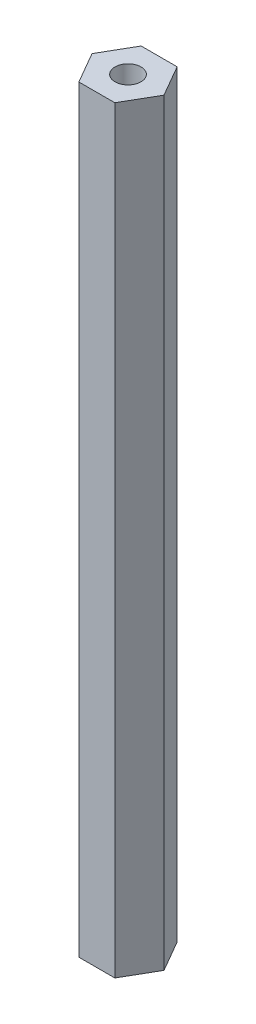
ISO-10303-21;
HEADER;
FILE_DESCRIPTION(('STEP AP214'),'2;1');
FILE_NAME('part.step','',(''),(''),'','','');
FILE_SCHEMA(('AUTOMOTIVE_DESIGN { 1 0 10303 214 1 1 1 1 }'));
ENDSEC;
DATA;
#1=APPLICATION_CONTEXT('core data for automotive mechanical design processes');
#2=APPLICATION_PROTOCOL_DEFINITION('international standard','automotive_design',2000,#1);
#3=PRODUCT_CONTEXT('',#1,'mechanical');
#4=PRODUCT('Part','Part','',(#3));
#5=PRODUCT_RELATED_PRODUCT_CATEGORY('part','',(#4));
#6=PRODUCT_DEFINITION_FORMATION('','',#4);
#7=PRODUCT_DEFINITION_CONTEXT('part definition',#1,'design');
#8=PRODUCT_DEFINITION('design','',#6,#7);
#9=PRODUCT_DEFINITION_SHAPE('','',#8);
#10=(LENGTH_UNIT() NAMED_UNIT(*) SI_UNIT(.MILLI.,.METRE.));
#11=(NAMED_UNIT(*) PLANE_ANGLE_UNIT() SI_UNIT($,.RADIAN.));
#12=(NAMED_UNIT(*) SI_UNIT($,.STERADIAN.) SOLID_ANGLE_UNIT());
#13=UNCERTAINTY_MEASURE_WITH_UNIT(LENGTH_MEASURE(1.E-05),#10,'distance_accuracy_value','');
#14=(GEOMETRIC_REPRESENTATION_CONTEXT(3) GLOBAL_UNCERTAINTY_ASSIGNED_CONTEXT((#13)) GLOBAL_UNIT_ASSIGNED_CONTEXT((#10,
#11,#12)) REPRESENTATION_CONTEXT('',''));
#15=CARTESIAN_POINT('',(0.,0.,0.));
#16=DIRECTION('',(0.,0.,1.));
#17=DIRECTION('',(1.,0.,0.));
#18=AXIS2_PLACEMENT_3D('',#15,#16,#17);
#19=CARTESIAN_POINT('',(1.73205080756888,73.,3.));
#20=DIRECTION('',(-0.866025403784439,0.,-0.5));
#21=DIRECTION('',(-0.5,0.,0.866025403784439));
#22=AXIS2_PLACEMENT_3D('',#19,#20,#21);
#23=PLANE('',#22);
#24=DIRECTION('',(0.5,0.,-0.866025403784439));
#25=VECTOR('',#24,1.);
#26=CARTESIAN_POINT('',(1.73205080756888,0.,3.));
#27=LINE('',#26,#25);
#28=CARTESIAN_POINT('',(1.73205080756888,0.,3.));
#29=VERTEX_POINT('',#28);
#30=CARTESIAN_POINT('',(3.46410161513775,0.,0.));
#31=VERTEX_POINT('',#30);
#32=EDGE_CURVE('E123',#29,#31,#27,.T.);
#33=ORIENTED_EDGE('',*,*,#32,.T.);
#34=DIRECTION('',(0.,-1.,0.));
#35=VECTOR('',#34,1.);
#36=CARTESIAN_POINT('',(3.46410161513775,73.,0.));
#37=LINE('',#36,#35);
#38=CARTESIAN_POINT('',(3.46410161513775,73.,0.));
#39=VERTEX_POINT('',#38);
#40=EDGE_CURVE('E11',#39,#31,#37,.T.);
#41=ORIENTED_EDGE('',*,*,#40,.F.);
#42=DIRECTION('',(0.5,0.,-0.866025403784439));
#43=VECTOR('',#42,1.);
#44=CARTESIAN_POINT('',(1.73205080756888,73.,3.));
#45=LINE('',#44,#43);
#46=CARTESIAN_POINT('',(1.73205080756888,73.,3.));
#47=VERTEX_POINT('',#46);
#48=EDGE_CURVE('E134',#47,#39,#45,.T.);
#49=ORIENTED_EDGE('',*,*,#48,.F.);
#50=DIRECTION('',(0.,-1.,0.));
#51=VECTOR('',#50,1.);
#52=CARTESIAN_POINT('',(1.73205080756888,73.,3.));
#53=LINE('',#52,#51);
#54=EDGE_CURVE('E119',#47,#29,#53,.T.);
#55=ORIENTED_EDGE('',*,*,#54,.T.);
#56=EDGE_LOOP('',(#33,#41,#49,#55));
#57=FACE_BOUND('',#56,.T.);
#58=ADVANCED_FACE('F36',(#57),#23,.F.);
#59=CARTESIAN_POINT('',(3.46410161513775,73.,0.));
#60=DIRECTION('',(-0.866025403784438,0.,0.5));
#61=DIRECTION('',(0.5,0.,0.866025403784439));
#62=AXIS2_PLACEMENT_3D('',#59,#60,#61);
#63=PLANE('',#62);
#64=DIRECTION('',(-0.5,0.,-0.866025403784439));
#65=VECTOR('',#64,1.);
#66=CARTESIAN_POINT('',(3.46410161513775,0.,0.));
#67=LINE('',#66,#65);
#68=CARTESIAN_POINT('',(1.73205080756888,0.,-3.));
#69=VERTEX_POINT('',#68);
#70=EDGE_CURVE('E126',#31,#69,#67,.T.);
#71=ORIENTED_EDGE('',*,*,#70,.T.);
#72=DIRECTION('',(0.,-1.,0.));
#73=VECTOR('',#72,1.);
#74=CARTESIAN_POINT('',(1.73205080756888,73.,-3.));
#75=LINE('',#74,#73);
#76=CARTESIAN_POINT('',(1.73205080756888,73.,-3.));
#77=VERTEX_POINT('',#76);
#78=EDGE_CURVE('E44',#77,#69,#75,.T.);
#79=ORIENTED_EDGE('',*,*,#78,.F.);
#80=DIRECTION('',(-0.5,0.,-0.866025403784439));
#81=VECTOR('',#80,1.);
#82=CARTESIAN_POINT('',(3.46410161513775,73.,0.));
#83=LINE('',#82,#81);
#84=EDGE_CURVE('E90',#39,#77,#83,.T.);
#85=ORIENTED_EDGE('',*,*,#84,.F.);
#86=ORIENTED_EDGE('',*,*,#40,.T.);
#87=EDGE_LOOP('',(#71,#79,#85,#86));
#88=FACE_BOUND('',#87,.T.);
#89=ADVANCED_FACE('F159',(#88),#63,.F.);
#90=CARTESIAN_POINT('',(1.73205080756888,73.,-3.));
#91=DIRECTION('',(0.,0.,1.));
#92=DIRECTION('',(1.,0.,0.));
#93=AXIS2_PLACEMENT_3D('',#90,#91,#92);
#94=PLANE('',#93);
#95=DIRECTION('',(-1.,0.,0.));
#96=VECTOR('',#95,1.);
#97=CARTESIAN_POINT('',(1.73205080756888,0.,-3.));
#98=LINE('',#97,#96);
#99=CARTESIAN_POINT('',(-1.73205080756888,0.,-3.));
#100=VERTEX_POINT('',#99);
#101=EDGE_CURVE('E129',#69,#100,#98,.T.);
#102=ORIENTED_EDGE('',*,*,#101,.T.);
#103=DIRECTION('',(0.,-1.,0.));
#104=VECTOR('',#103,1.);
#105=CARTESIAN_POINT('',(-1.73205080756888,73.,-3.));
#106=LINE('',#105,#104);
#107=CARTESIAN_POINT('',(-1.73205080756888,73.,-3.));
#108=VERTEX_POINT('',#107);
#109=EDGE_CURVE('E114',#108,#100,#106,.T.);
#110=ORIENTED_EDGE('',*,*,#109,.F.);
#111=DIRECTION('',(-1.,0.,0.));
#112=VECTOR('',#111,1.);
#113=CARTESIAN_POINT('',(1.73205080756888,73.,-3.));
#114=LINE('',#113,#112);
#115=EDGE_CURVE('E105',#77,#108,#114,.T.);
#116=ORIENTED_EDGE('',*,*,#115,.F.);
#117=ORIENTED_EDGE('',*,*,#78,.T.);
#118=EDGE_LOOP('',(#102,#110,#116,#117));
#119=FACE_BOUND('',#118,.T.);
#120=ADVANCED_FACE('F140',(#119),#94,.F.);
#121=CARTESIAN_POINT('',(-1.73205080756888,73.,-3.));
#122=DIRECTION('',(0.866025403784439,0.,0.5));
#123=DIRECTION('',(0.5,0.,-0.866025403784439));
#124=AXIS2_PLACEMENT_3D('',#121,#122,#123);
#125=PLANE('',#124);
#126=DIRECTION('',(-0.5,0.,0.866025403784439));
#127=VECTOR('',#126,1.);
#128=CARTESIAN_POINT('',(-1.73205080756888,0.,-3.));
#129=LINE('',#128,#127);
#130=CARTESIAN_POINT('',(-3.46410161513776,0.,0.));
#131=VERTEX_POINT('',#130);
#132=EDGE_CURVE('E113',#100,#131,#129,.T.);
#133=ORIENTED_EDGE('',*,*,#132,.T.);
#134=DIRECTION('',(0.,-1.,0.));
#135=VECTOR('',#134,1.);
#136=CARTESIAN_POINT('',(-3.46410161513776,73.,0.));
#137=LINE('',#136,#135);
#138=CARTESIAN_POINT('',(-3.46410161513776,73.,0.));
#139=VERTEX_POINT('',#138);
#140=EDGE_CURVE('E110',#139,#131,#137,.T.);
#141=ORIENTED_EDGE('',*,*,#140,.F.);
#142=DIRECTION('',(-0.5,0.,0.866025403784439));
#143=VECTOR('',#142,1.);
#144=CARTESIAN_POINT('',(-1.73205080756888,73.,-3.));
#145=LINE('',#144,#143);
#146=EDGE_CURVE('E99',#108,#139,#145,.T.);
#147=ORIENTED_EDGE('',*,*,#146,.F.);
#148=ORIENTED_EDGE('',*,*,#109,.T.);
#149=EDGE_LOOP('',(#133,#141,#147,#148));
#150=FACE_BOUND('',#149,.T.);
#151=ADVANCED_FACE('F111',(#150),#125,.F.);
#152=CARTESIAN_POINT('',(-3.46410161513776,73.,0.));
#153=DIRECTION('',(0.866025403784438,0.,-0.5));
#154=DIRECTION('',(-0.5,0.,-0.866025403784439));
#155=AXIS2_PLACEMENT_3D('',#152,#153,#154);
#156=PLANE('',#155);
#157=DIRECTION('',(0.5,0.,0.866025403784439));
#158=VECTOR('',#157,1.);
#159=CARTESIAN_POINT('',(-3.46410161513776,0.,0.));
#160=LINE('',#159,#158);
#161=CARTESIAN_POINT('',(-1.73205080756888,0.,3.));
#162=VERTEX_POINT('',#161);
#163=EDGE_CURVE('E76',#131,#162,#160,.T.);
#164=ORIENTED_EDGE('',*,*,#163,.T.);
#165=DIRECTION('',(0.,-1.,0.));
#166=VECTOR('',#165,1.);
#167=CARTESIAN_POINT('',(-1.73205080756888,73.,3.));
#168=LINE('',#167,#166);
#169=CARTESIAN_POINT('',(-1.73205080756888,73.,3.));
#170=VERTEX_POINT('',#169);
#171=EDGE_CURVE('E115',#170,#162,#168,.T.);
#172=ORIENTED_EDGE('',*,*,#171,.F.);
#173=DIRECTION('',(0.5,0.,0.866025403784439));
#174=VECTOR('',#173,1.);
#175=CARTESIAN_POINT('',(-3.46410161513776,73.,0.));
#176=LINE('',#175,#174);
#177=EDGE_CURVE('E103',#139,#170,#176,.T.);
#178=ORIENTED_EDGE('',*,*,#177,.F.);
#179=ORIENTED_EDGE('',*,*,#140,.T.);
#180=EDGE_LOOP('',(#164,#172,#178,#179));
#181=FACE_BOUND('',#180,.T.);
#182=ADVANCED_FACE('F117',(#181),#156,.F.);
#183=CARTESIAN_POINT('',(-1.73205080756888,73.,3.));
#184=DIRECTION('',(0.,0.,-1.));
#185=DIRECTION('',(-1.,0.,0.));
#186=AXIS2_PLACEMENT_3D('',#183,#184,#185);
#187=PLANE('',#186);
#188=DIRECTION('',(1.,0.,0.));
#189=VECTOR('',#188,1.);
#190=CARTESIAN_POINT('',(-1.73205080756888,0.,3.));
#191=LINE('',#190,#189);
#192=EDGE_CURVE('E82',#162,#29,#191,.T.);
#193=ORIENTED_EDGE('',*,*,#192,.T.);
#194=ORIENTED_EDGE('',*,*,#54,.F.);
#195=DIRECTION('',(1.,0.,0.));
#196=VECTOR('',#195,1.);
#197=CARTESIAN_POINT('',(-1.73205080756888,73.,3.));
#198=LINE('',#197,#196);
#199=EDGE_CURVE('E52',#170,#47,#198,.T.);
#200=ORIENTED_EDGE('',*,*,#199,.F.);
#201=ORIENTED_EDGE('',*,*,#171,.T.);
#202=EDGE_LOOP('',(#193,#194,#200,#201));
#203=FACE_BOUND('',#202,.T.);
#204=ADVANCED_FACE('F147',(#203),#187,.F.);
#205=CARTESIAN_POINT('',(0.,73.,0.));
#206=DIRECTION('',(0.,1.,0.));
#207=DIRECTION('',(0.,0.,1.));
#208=AXIS2_PLACEMENT_3D('',#205,#206,#207);
#209=PLANE('',#208);
#210=CARTESIAN_POINT('',(0.,73.,0.));
#211=DIRECTION('',(0.,1.,0.));
#212=DIRECTION('',(0.,0.,1.));
#213=AXIS2_PLACEMENT_3D('',#210,#211,#212);
#214=CIRCLE('',#213,1.24999999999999);
#215=CARTESIAN_POINT('',(0.,73.,1.24999999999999));
#216=VERTEX_POINT('',#215);
#217=EDGE_CURVE('E248',#216,#216,#214,.T.);
#218=ORIENTED_EDGE('',*,*,#217,.F.);
#219=EDGE_LOOP('',(#218));
#220=FACE_BOUND('',#219,.T.);
#221=ORIENTED_EDGE('',*,*,#48,.T.);
#222=ORIENTED_EDGE('',*,*,#84,.T.);
#223=ORIENTED_EDGE('',*,*,#115,.T.);
#224=ORIENTED_EDGE('',*,*,#146,.T.);
#225=ORIENTED_EDGE('',*,*,#177,.T.);
#226=ORIENTED_EDGE('',*,*,#199,.T.);
#227=EDGE_LOOP('',(#221,#222,#223,#224,#225,#226));
#228=FACE_BOUND('',#227,.T.);
#229=ADVANCED_FACE('F101',(#220,#228),#209,.T.);
#230=CARTESIAN_POINT('',(0.,0.,0.));
#231=DIRECTION('',(0.,1.,0.));
#232=DIRECTION('',(0.,0.,1.));
#233=AXIS2_PLACEMENT_3D('',#230,#231,#232);
#234=PLANE('',#233);
#235=CARTESIAN_POINT('',(0.,0.,0.));
#236=DIRECTION('',(0.,-1.,0.));
#237=DIRECTION('',(0.,0.,-1.));
#238=AXIS2_PLACEMENT_3D('',#235,#236,#237);
#239=CIRCLE('',#238,1.24999999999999);
#240=CARTESIAN_POINT('',(0.,0.,-1.24999999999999));
#241=VERTEX_POINT('',#240);
#242=EDGE_CURVE('E250',#241,#241,#239,.T.);
#243=ORIENTED_EDGE('',*,*,#242,.F.);
#244=EDGE_LOOP('',(#243));
#245=FACE_BOUND('',#244,.T.);
#246=ORIENTED_EDGE('',*,*,#32,.F.);
#247=ORIENTED_EDGE('',*,*,#192,.F.);
#248=ORIENTED_EDGE('',*,*,#163,.F.);
#249=ORIENTED_EDGE('',*,*,#132,.F.);
#250=ORIENTED_EDGE('',*,*,#101,.F.);
#251=ORIENTED_EDGE('',*,*,#70,.F.);
#252=EDGE_LOOP('',(#246,#247,#248,#249,#250,#251));
#253=FACE_BOUND('',#252,.T.);
#254=ADVANCED_FACE('F143',(#245,#253),#234,.F.);
#255=CARTESIAN_POINT('',(0.,12.,0.));
#256=DIRECTION('',(0.,-1.,0.));
#257=DIRECTION('',(0.,0.,-1.));
#258=AXIS2_PLACEMENT_3D('',#255,#256,#257);
#259=CONICAL_SURFACE('',#258,1.25,1.02974425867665);
#260=CARTESIAN_POINT('',(0.,12.7510757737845,0.));
#261=VERTEX_POINT('',#260);
#262=VERTEX_LOOP('',#261);
#263=FACE_BOUND('',#262,.T.);
#264=CARTESIAN_POINT('',(0.,12.,0.));
#265=DIRECTION('',(0.,-1.,0.));
#266=DIRECTION('',(0.,0.,-1.));
#267=AXIS2_PLACEMENT_3D('',#264,#265,#266);
#268=CIRCLE('',#267,1.25);
#269=CARTESIAN_POINT('',(0.,12.,-1.25));
#270=VERTEX_POINT('',#269);
#271=EDGE_CURVE('E127',#270,#270,#268,.T.);
#272=ORIENTED_EDGE('',*,*,#271,.T.);
#273=EDGE_LOOP('',(#272));
#274=FACE_BOUND('',#273,.T.);
#275=ADVANCED_FACE('F191',(#263,#274),#259,.F.);
#276=CARTESIAN_POINT('',(0.,0.,0.));
#277=DIRECTION('',(0.,-1.,0.));
#278=DIRECTION('',(0.,0.,-1.));
#279=AXIS2_PLACEMENT_3D('',#276,#277,#278);
#280=CYLINDRICAL_SURFACE('',#279,1.24999999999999);
#281=ORIENTED_EDGE('',*,*,#271,.F.);
#282=EDGE_LOOP('',(#281));
#283=FACE_BOUND('',#282,.T.);
#284=ORIENTED_EDGE('',*,*,#242,.T.);
#285=EDGE_LOOP('',(#284));
#286=FACE_BOUND('',#285,.T.);
#287=ADVANCED_FACE('F200',(#283,#286),#280,.F.);
#288=CARTESIAN_POINT('',(0.,61.,0.));
#289=DIRECTION('',(0.,1.,0.));
#290=DIRECTION('',(0.,0.,1.));
#291=AXIS2_PLACEMENT_3D('',#288,#289,#290);
#292=CONICAL_SURFACE('',#291,1.25,1.02974425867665);
#293=CARTESIAN_POINT('',(0.,60.2489242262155,0.));
#294=VERTEX_POINT('',#293);
#295=VERTEX_LOOP('',#294);
#296=FACE_BOUND('',#295,.T.);
#297=CARTESIAN_POINT('',(0.,61.,0.));
#298=DIRECTION('',(0.,1.,0.));
#299=DIRECTION('',(0.,0.,1.));
#300=AXIS2_PLACEMENT_3D('',#297,#298,#299);
#301=CIRCLE('',#300,1.25);
#302=CARTESIAN_POINT('',(0.,61.,1.25));
#303=VERTEX_POINT('',#302);
#304=EDGE_CURVE('E245',#303,#303,#301,.T.);
#305=ORIENTED_EDGE('',*,*,#304,.T.);
#306=EDGE_LOOP('',(#305));
#307=FACE_BOUND('',#306,.T.);
#308=ADVANCED_FACE('F211',(#296,#307),#292,.F.);
#309=CARTESIAN_POINT('',(0.,73.,0.));
#310=DIRECTION('',(0.,1.,0.));
#311=DIRECTION('',(0.,0.,1.));
#312=AXIS2_PLACEMENT_3D('',#309,#310,#311);
#313=CYLINDRICAL_SURFACE('',#312,1.24999999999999);
#314=ORIENTED_EDGE('',*,*,#304,.F.);
#315=EDGE_LOOP('',(#314));
#316=FACE_BOUND('',#315,.T.);
#317=ORIENTED_EDGE('',*,*,#217,.T.);
#318=EDGE_LOOP('',(#317));
#319=FACE_BOUND('',#318,.T.);
#320=ADVANCED_FACE('F227',(#316,#319),#313,.F.);
#321=CLOSED_SHELL('',(#58,#89,#120,#151,#182,#204,#229,#254,#275,#287,#308,#320));
#322=MANIFOLD_SOLID_BREP('B2',#321);
#323=ADVANCED_BREP_SHAPE_REPRESENTATION('',(#18,#322),#14);
#324=SHAPE_DEFINITION_REPRESENTATION(#9,#323);
ENDSEC;
END-ISO-10303-21;
